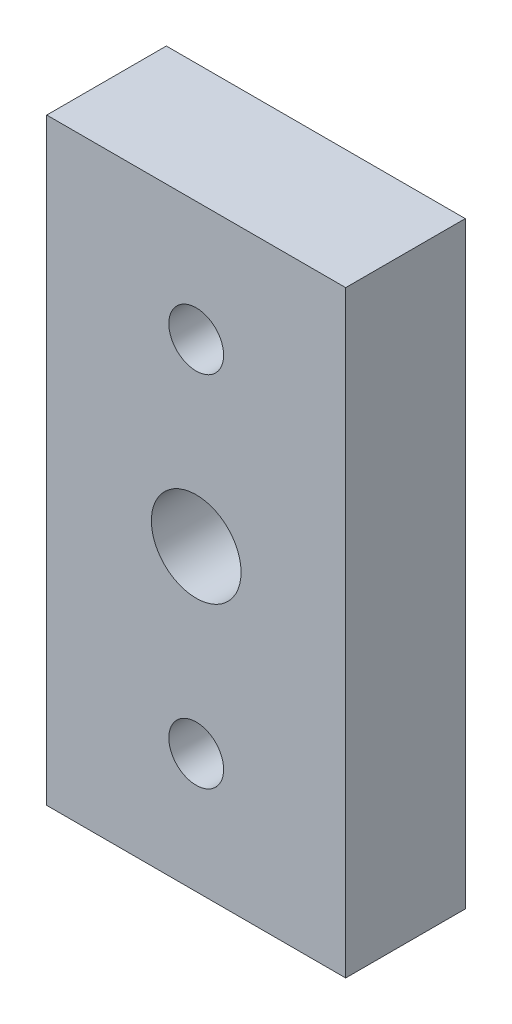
ISO-10303-21;
HEADER;
FILE_DESCRIPTION(('STEP AP214'),'2;1');
FILE_NAME('part.step','',(''),(''),'','','');
FILE_SCHEMA(('AUTOMOTIVE_DESIGN { 1 0 10303 214 1 1 1 1 }'));
ENDSEC;
DATA;
#1=APPLICATION_CONTEXT('core data for automotive mechanical design processes');
#2=APPLICATION_PROTOCOL_DEFINITION('international standard','automotive_design',2000,#1);
#3=PRODUCT_CONTEXT('',#1,'mechanical');
#4=PRODUCT('Part','Part','',(#3));
#5=PRODUCT_RELATED_PRODUCT_CATEGORY('part','',(#4));
#6=PRODUCT_DEFINITION_FORMATION('','',#4);
#7=PRODUCT_DEFINITION_CONTEXT('part definition',#1,'design');
#8=PRODUCT_DEFINITION('design','',#6,#7);
#9=PRODUCT_DEFINITION_SHAPE('','',#8);
#10=(LENGTH_UNIT() NAMED_UNIT(*) SI_UNIT(.MILLI.,.METRE.));
#11=(NAMED_UNIT(*) PLANE_ANGLE_UNIT() SI_UNIT($,.RADIAN.));
#12=(NAMED_UNIT(*) SI_UNIT($,.STERADIAN.) SOLID_ANGLE_UNIT());
#13=UNCERTAINTY_MEASURE_WITH_UNIT(LENGTH_MEASURE(1.E-05),#10,'distance_accuracy_value','');
#14=(GEOMETRIC_REPRESENTATION_CONTEXT(3) GLOBAL_UNCERTAINTY_ASSIGNED_CONTEXT((#13)) GLOBAL_UNIT_ASSIGNED_CONTEXT((#10,
#11,#12)) REPRESENTATION_CONTEXT('',''));
#15=CARTESIAN_POINT('',(0.,0.,0.));
#16=DIRECTION('',(0.,0.,1.));
#17=DIRECTION('',(1.,0.,0.));
#18=AXIS2_PLACEMENT_3D('',#15,#16,#17);
#19=CARTESIAN_POINT('',(15.,-18.,-1.));
#20=DIRECTION('',(0.,0.,-1.));
#21=DIRECTION('',(0.,1.,0.));
#22=AXIS2_PLACEMENT_3D('',#19,#20,#21);
#23=CYLINDRICAL_SURFACE('',#22,5.);
#24=CARTESIAN_POINT('',(15.,-18.,-1.));
#25=DIRECTION('',(0.,0.,-1.));
#26=DIRECTION('',(0.,1.,0.));
#27=AXIS2_PLACEMENT_3D('',#24,#25,#26);
#28=CIRCLE('',#27,5.);
#29=CARTESIAN_POINT('',(10.0023531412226,-18.1533814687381,-1.));
#30=VERTEX_POINT('',#29);
#31=CARTESIAN_POINT('',(11.8057041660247,-21.8466185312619,-1.));
#32=VERTEX_POINT('',#31);
#33=EDGE_CURVE('E284',#30,#32,#28,.T.);
#34=ORIENTED_EDGE('',*,*,#33,.F.);
#35=CARTESIAN_POINT('',(10.0023531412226,-18.1533814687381,-1.));
#36=CARTESIAN_POINT('',(10.0031940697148,-18.1807028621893,-1.05046474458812));
#37=CARTESIAN_POINT('',(10.0043182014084,-18.2101012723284,-1.09980010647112));
#38=CARTESIAN_POINT('',(10.0073494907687,-18.2728249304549,-1.19588974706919));
#39=CARTESIAN_POINT('',(10.0092567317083,-18.306150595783,-1.24264375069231));
#40=CARTESIAN_POINT('',(10.0140708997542,-18.3764975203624,-1.33323987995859));
#41=CARTESIAN_POINT('',(10.016977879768,-18.4135189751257,-1.37708185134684));
#42=CARTESIAN_POINT('',(10.024009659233,-18.4909536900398,-1.46152881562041));
#43=CARTESIAN_POINT('',(10.0281343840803,-18.5313667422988,-1.50213400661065));
#44=CARTESIAN_POINT('',(10.0426828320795,-18.6573701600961,-1.61877072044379));
#45=CARTESIAN_POINT('',(10.0552785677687,-18.7476835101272,-1.68957038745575));
#46=CARTESIAN_POINT('',(10.0877541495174,-18.9376045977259,-1.81501358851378));
#47=CARTESIAN_POINT('',(10.1076299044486,-19.0372070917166,-1.86966616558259));
#48=CARTESIAN_POINT('',(10.1551019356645,-19.2399872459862,-1.96073151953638));
#49=CARTESIAN_POINT('',(10.1825219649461,-19.3430410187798,-1.99751316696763));
#50=CARTESIAN_POINT('',(10.2454605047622,-19.5511739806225,-2.05430612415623));
#51=CARTESIAN_POINT('',(10.2809705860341,-19.656250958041,-2.07433478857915));
#52=CARTESIAN_POINT('',(10.3353654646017,-19.8008449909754,-2.09092796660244));
#53=CARTESIAN_POINT('',(10.3510331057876,-19.8409129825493,-2.09434711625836));
#54=CARTESIAN_POINT('',(10.3834345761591,-19.9207237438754,-2.09888349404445));
#55=CARTESIAN_POINT('',(10.4001678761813,-19.9604666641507,-2.10000185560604));
#56=CARTESIAN_POINT('',(10.474200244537,-20.1300699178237,-2.09999389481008));
#57=CARTESIAN_POINT('',(10.5366390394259,-20.2578710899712,-2.08786146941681));
#58=CARTESIAN_POINT('',(10.6704427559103,-20.5049631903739,-2.04228193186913));
#59=CARTESIAN_POINT('',(10.7418386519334,-20.6242222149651,-2.00875912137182));
#60=CARTESIAN_POINT('',(10.8901450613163,-20.8508398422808,-1.92369467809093));
#61=CARTESIAN_POINT('',(10.9670076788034,-20.9582848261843,-1.87229713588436));
#62=CARTESIAN_POINT('',(11.1240160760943,-21.1612000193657,-1.75369017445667));
#63=CARTESIAN_POINT('',(11.2041592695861,-21.2566794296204,-1.68649302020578));
#64=CARTESIAN_POINT('',(11.329524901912,-21.3959044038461,-1.5702542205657));
#65=CARTESIAN_POINT('',(11.3746492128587,-21.4439755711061,-1.52617308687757));
#66=CARTESIAN_POINT('',(11.4643905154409,-21.5360421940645,-1.43347117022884));
#67=CARTESIAN_POINT('',(11.5090076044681,-21.5800384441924,-1.38485127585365));
#68=CARTESIAN_POINT('',(11.5970226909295,-21.6637990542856,-1.28301646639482));
#69=CARTESIAN_POINT('',(11.6404203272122,-21.7035621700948,-1.22980020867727));
#70=CARTESIAN_POINT('',(11.7249953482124,-21.7785692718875,-1.11855252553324));
#71=CARTESIAN_POINT('',(11.7661708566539,-21.8138094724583,-1.06051713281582));
#72=CARTESIAN_POINT('',(11.8057041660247,-21.8466185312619,-1.));
#73=B_SPLINE_CURVE_WITH_KNOTS('',3,(#35,#36,#37,#38,#39,#40,#41,#42,#43,#44,#45,#46,#47,#48,#49,
#50,#51,#52,#53,#54,#55,#56,#57,#58,#59,#60,#61,#62,#63,#64,#65,#66,#67,#68,#69,#70,#71,#72),
.UNSPECIFIED.,.F.,.F.,(4,2,2,2,2,2,2,2,2,2,2,2,2,2,2,2,2,2,4),(0.,0.172126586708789,
0.344271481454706,0.516425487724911,0.688568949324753,1.03305493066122,1.37734761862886,
1.7141951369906,2.05069327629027,2.18010948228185,2.30946191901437,2.73504859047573,
3.16214978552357,3.58588494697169,4.00929224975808,4.24702628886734,4.48471388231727,
4.72247114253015,4.9604261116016),.UNSPECIFIED.);
#74=EDGE_CURVE('E127',#30,#32,#73,.T.);
#75=ORIENTED_EDGE('',*,*,#74,.T.);
#76=EDGE_LOOP('',(#34,#75));
#77=FACE_BOUND('',#76,.T.);
#78=CARTESIAN_POINT('',(15.,-18.,-6.));
#79=DIRECTION('',(0.,0.,-1.));
#80=DIRECTION('',(0.,1.,0.));
#81=AXIS2_PLACEMENT_3D('',#78,#79,#80);
#82=CIRCLE('',#81,5.);
#83=CARTESIAN_POINT('',(15.,-13.,-6.));
#84=VERTEX_POINT('',#83);
#85=EDGE_CURVE('E350',#84,#84,#82,.T.);
#86=ORIENTED_EDGE('',*,*,#85,.T.);
#87=EDGE_LOOP('',(#86));
#88=FACE_BOUND('',#87,.T.);
#89=ADVANCED_FACE('F17',(#77,#88),#23,.F.);
#90=CARTESIAN_POINT('',(15.,18.,-0.999999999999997));
#91=DIRECTION('',(0.,0.,-1.));
#92=DIRECTION('',(0.,1.,0.));
#93=AXIS2_PLACEMENT_3D('',#90,#91,#92);
#94=CYLINDRICAL_SURFACE('',#93,5.);
#95=CARTESIAN_POINT('',(15.,18.,-0.999999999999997));
#96=DIRECTION('',(0.,0.,-1.));
#97=DIRECTION('',(0.,1.,0.));
#98=AXIS2_PLACEMENT_3D('',#95,#96,#97);
#99=CIRCLE('',#98,5.);
#100=CARTESIAN_POINT('',(11.8057041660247,21.8466185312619,-0.999999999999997));
#101=VERTEX_POINT('',#100);
#102=CARTESIAN_POINT('',(10.0023531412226,18.1533814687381,-0.999999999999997));
#103=VERTEX_POINT('',#102);
#104=EDGE_CURVE('E123',#101,#103,#99,.T.);
#105=ORIENTED_EDGE('',*,*,#104,.F.);
#106=CARTESIAN_POINT('',(11.8057041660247,21.8466185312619,-0.999999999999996));
#107=CARTESIAN_POINT('',(11.7834305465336,21.8281239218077,-1.03414557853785));
#108=CARTESIAN_POINT('',(11.760610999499,21.8088454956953,-1.0674909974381));
#109=CARTESIAN_POINT('',(11.7141016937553,21.7687943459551,-1.13262108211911));
#110=CARTESIAN_POINT('',(11.6904122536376,21.7480221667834,-1.16440630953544));
#111=CARTESIAN_POINT('',(11.6183967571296,21.6835989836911,-1.2574521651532));
#112=CARTESIAN_POINT('',(11.5690759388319,21.6378022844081,-1.3164743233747));
#113=CARTESIAN_POINT('',(11.4688748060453,21.5406286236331,-1.42899049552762));
#114=CARTESIAN_POINT('',(11.4179879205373,21.4892248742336,-1.48245535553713));
#115=CARTESIAN_POINT('',(11.3158998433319,21.3812636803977,-1.58353477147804));
#116=CARTESIAN_POINT('',(11.2646985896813,21.3247051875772,-1.63114813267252));
#117=CARTESIAN_POINT('',(11.1213350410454,21.1584621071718,-1.7566977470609));
#118=CARTESIAN_POINT('',(11.029695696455,21.0429527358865,-1.82783578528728));
#119=CARTESIAN_POINT('',(10.8970401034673,20.8585797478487,-1.91767974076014));
#120=CARTESIAN_POINT('',(10.853666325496,20.7953447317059,-1.94479702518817));
#121=CARTESIAN_POINT('',(10.7689270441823,20.6653382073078,-1.99302030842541));
#122=CARTESIAN_POINT('',(10.7275607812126,20.5985680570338,-2.01412859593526));
#123=CARTESIAN_POINT('',(10.6380455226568,20.445991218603,-2.05393746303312));
#124=CARTESIAN_POINT('',(10.5905412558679,20.3593540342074,-2.07095136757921));
#125=CARTESIAN_POINT('',(10.5002481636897,20.1822279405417,-2.09398428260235));
#126=CARTESIAN_POINT('',(10.4574591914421,20.091739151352,-2.10000363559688));
#127=CARTESIAN_POINT('',(10.3709483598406,19.8935012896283,-2.09999577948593));
#128=CARTESIAN_POINT('',(10.328183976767,19.7853175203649,-2.09187463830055));
#129=CARTESIAN_POINT('',(10.251039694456,19.5686314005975,-2.0581395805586));
#130=CARTESIAN_POINT('',(10.2166603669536,19.4601290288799,-2.03252447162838));
#131=CARTESIAN_POINT('',(10.1565131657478,19.246199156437,-1.96327498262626));
#132=CARTESIAN_POINT('',(10.1307659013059,19.1407795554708,-1.91959802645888));
#133=CARTESIAN_POINT('',(10.0875033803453,18.9371386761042,-1.81478300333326));
#134=CARTESIAN_POINT('',(10.0699898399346,18.8389189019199,-1.7536413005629));
#135=CARTESIAN_POINT('',(10.0424888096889,18.6567186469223,-1.61803269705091));
#136=CARTESIAN_POINT('',(10.0322478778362,18.5723469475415,-1.54413953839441));
#137=CARTESIAN_POINT('',(10.0167440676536,18.416308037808,-1.38362432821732));
#138=CARTESIAN_POINT('',(10.0114755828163,18.3446265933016,-1.29701674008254));
#139=CARTESIAN_POINT('',(10.0065667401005,18.2572186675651,-1.1723252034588));
#140=CARTESIAN_POINT('',(10.005482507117,18.2350466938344,-1.13866923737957));
#141=CARTESIAN_POINT('',(10.0036705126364,18.1927109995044,-1.07019583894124));
#142=CARTESIAN_POINT('',(10.0029420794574,18.1725435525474,-1.03538072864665));
#143=CARTESIAN_POINT('',(10.0023531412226,18.1533814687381,-0.999999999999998));
#144=B_SPLINE_CURVE_WITH_KNOTS('',3,(#106,#107,#108,#109,#110,#111,#112,#113,#114,#115,#116,
#117,#118,#119,#120,#121,#122,#123,#124,#125,#126,#127,#128,#129,#130,#131,#132,#133,#134,#135,
#136,#137,#138,#139,#140,#141,#142,#143),.UNSPECIFIED.,.F.,.F.,(4,2,2,2,2,2,2,2,2,2,2,2,2,2,2,2,
2,2,4),(0.,0.134259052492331,0.268469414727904,0.536608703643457,0.806090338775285,
1.07562690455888,1.56418087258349,1.80793285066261,2.05159186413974,2.35161892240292,
2.65163663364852,2.99992303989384,3.34823318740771,3.69736910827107,4.04657776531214,
4.3829242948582,4.7188911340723,4.83979261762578,4.9604649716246),.UNSPECIFIED.);
#145=EDGE_CURVE('E21',#101,#103,#144,.T.);
#146=ORIENTED_EDGE('',*,*,#145,.T.);
#147=EDGE_LOOP('',(#105,#146));
#148=FACE_BOUND('',#147,.T.);
#149=CARTESIAN_POINT('',(15.,18.,-6.));
#150=DIRECTION('',(0.,0.,-1.));
#151=DIRECTION('',(0.,1.,0.));
#152=AXIS2_PLACEMENT_3D('',#149,#150,#151);
#153=CIRCLE('',#152,5.);
#154=CARTESIAN_POINT('',(15.,23.,-6.));
#155=VERTEX_POINT('',#154);
#156=EDGE_CURVE('E348',#155,#155,#153,.T.);
#157=ORIENTED_EDGE('',*,*,#156,.T.);
#158=EDGE_LOOP('',(#157));
#159=FACE_BOUND('',#158,.T.);
#160=ADVANCED_FACE('F121',(#148,#159),#94,.F.);
#161=CARTESIAN_POINT('',(0.,20.,0.));
#162=DIRECTION('',(-1.,0.,0.));
#163=DIRECTION('',(0.,0.,1.));
#164=AXIS2_PLACEMENT_3D('',#161,#162,#163);
#165=CYLINDRICAL_SURFACE('',#164,2.1);
#166=CARTESIAN_POINT('',(12.4000000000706,20.,0.));
#167=DIRECTION('',(-1.,0.,0.));
#168=DIRECTION('',(0.,0.,1.));
#169=AXIS2_PLACEMENT_3D('',#166,#167,#168);
#170=CIRCLE('',#169,2.09999999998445);
#171=CARTESIAN_POINT('',(12.4000000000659,21.8466185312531,-0.999999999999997));
#172=VERTEX_POINT('',#171);
#173=CARTESIAN_POINT('',(12.4000000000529,20.,2.09999999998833));
#174=VERTEX_POINT('',#173);
#175=EDGE_CURVE('E156',#172,#174,#170,.F.);
#176=ORIENTED_EDGE('',*,*,#175,.T.);
#177=CARTESIAN_POINT('',(12.4000000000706,20.,0.));
#178=DIRECTION('',(-1.,0.,0.));
#179=DIRECTION('',(0.,0.,1.));
#180=AXIS2_PLACEMENT_3D('',#177,#178,#179);
#181=CIRCLE('',#180,2.09999999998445);
#182=CARTESIAN_POINT('',(12.4000000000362,18.8958236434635,1.78627953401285));
#183=VERTEX_POINT('',#182);
#184=EDGE_CURVE('E315',#174,#183,#181,.F.);
#185=ORIENTED_EDGE('',*,*,#184,.T.);
#186=CARTESIAN_POINT('',(12.4000000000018,18.8958236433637,1.78627953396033));
#187=CARTESIAN_POINT('',(12.3847910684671,18.8517040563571,1.75902403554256));
#188=CARTESIAN_POINT('',(12.3710813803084,18.8082457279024,1.72988584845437));
#189=CARTESIAN_POINT('',(12.3464169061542,18.7231509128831,1.66805433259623));
#190=CARTESIAN_POINT('',(12.3354605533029,18.6815134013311,1.63536304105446));
#191=CARTESIAN_POINT('',(12.3160643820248,18.600599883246,1.56668189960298));
#192=CARTESIAN_POINT('',(12.3076189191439,18.5613187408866,1.53069968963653));
#193=CARTESIAN_POINT('',(12.2929040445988,18.4854131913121,1.45563715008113));
#194=CARTESIAN_POINT('',(12.2866347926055,18.4487889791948,1.41655659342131));
#195=CARTESIAN_POINT('',(12.2706198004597,18.3435343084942,1.29520218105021));
#196=CARTESIAN_POINT('',(12.2636240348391,18.2793272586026,1.20865080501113));
#197=CARTESIAN_POINT('',(12.2543497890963,18.1649575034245,1.0267214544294));
#198=CARTESIAN_POINT('',(12.2520637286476,18.1147723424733,0.931357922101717));
#199=CARTESIAN_POINT('',(12.2505915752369,18.0586024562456,0.801345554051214));
#200=CARTESIAN_POINT('',(12.2503545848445,18.0457811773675,0.769547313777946));
#201=CARTESIAN_POINT('',(12.2500594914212,18.0217071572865,0.705360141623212));
#202=CARTESIAN_POINT('',(12.2500014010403,18.0104545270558,0.672971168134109));
#203=CARTESIAN_POINT('',(12.2499951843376,17.9640656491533,0.528057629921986));
#204=CARTESIAN_POINT('',(12.2506601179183,17.9375603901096,0.412615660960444));
#205=CARTESIAN_POINT('',(12.2516142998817,17.9042831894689,0.178768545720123));
#206=CARTESIAN_POINT('',(12.2519028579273,17.8975474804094,0.0603583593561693));
#207=CARTESIAN_POINT('',(12.251695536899,17.9035116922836,-0.156605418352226));
#208=CARTESIAN_POINT('',(12.2513198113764,17.913223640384,-0.255250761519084));
#209=CARTESIAN_POINT('',(12.2504712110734,17.9464266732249,-0.450089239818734));
#210=CARTESIAN_POINT('',(12.2499984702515,17.9698988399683,-0.546285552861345));
#211=CARTESIAN_POINT('',(12.2500010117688,18.0199087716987,-0.702501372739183));
#212=CARTESIAN_POINT('',(12.2502094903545,18.0427173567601,-0.763741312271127));
#213=CARTESIAN_POINT('',(12.2514879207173,18.0939159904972,-0.883801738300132));
#214=CARTESIAN_POINT('',(12.252557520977,18.1223037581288,-0.942623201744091));
#215=CARTESIAN_POINT('',(12.2542807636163,18.1533814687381,-0.999999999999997));
#216=B_SPLINE_CURVE_WITH_KNOTS('',3,(#186,#187,#188,#189,#190,#191,#192,#193,#194,#195,#196,
#197,#198,#199,#200,#201,#202,#203,#204,#205,#206,#207,#208,#209,#210,#211,#212,#213,#214,#215),
.UNSPECIFIED.,.F.,.F.,(4,2,2,2,2,2,2,2,2,2,2,2,2,2,4),(0.,0.162056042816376,0.324019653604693,
0.485616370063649,0.647224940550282,0.969676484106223,1.29160863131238,1.39443809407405,
1.49727482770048,1.85074574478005,2.20486408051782,2.50128318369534,2.79729571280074,
2.99307706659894,3.18877854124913),.UNSPECIFIED.);
#217=CARTESIAN_POINT('',(12.2542807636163,18.1533814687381,-0.999999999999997));
#218=VERTEX_POINT('',#217);
#219=EDGE_CURVE('E143',#183,#218,#216,.T.);
#220=ORIENTED_EDGE('',*,*,#219,.T.);
#221=DIRECTION('',(1.,0.,0.));
#222=VECTOR('',#221,1.);
#223=CARTESIAN_POINT('',(15.,18.1533814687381,-0.999999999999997));
#224=LINE('',#223,#222);
#225=EDGE_CURVE('E132',#103,#218,#224,.T.);
#226=ORIENTED_EDGE('',*,*,#225,.F.);
#227=ORIENTED_EDGE('',*,*,#145,.F.);
#228=DIRECTION('',(1.,0.,0.));
#229=VECTOR('',#228,1.);
#230=CARTESIAN_POINT('',(15.,21.8466185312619,-0.999999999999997));
#231=LINE('',#230,#229);
#232=EDGE_CURVE('E135',#172,#101,#231,.F.);
#233=ORIENTED_EDGE('',*,*,#232,.F.);
#234=EDGE_LOOP('',(#176,#185,#220,#226,#227,#233));
#235=FACE_BOUND('',#234,.T.);
#236=CARTESIAN_POINT('',(0.,20.,0.));
#237=DIRECTION('',(-1.,0.,0.));
#238=DIRECTION('',(0.,0.,1.));
#239=AXIS2_PLACEMENT_3D('',#236,#237,#238);
#240=CIRCLE('',#239,2.1);
#241=CARTESIAN_POINT('',(0.,20.,2.09999999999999));
#242=VERTEX_POINT('',#241);
#243=EDGE_CURVE('E344',#242,#242,#240,.T.);
#244=ORIENTED_EDGE('',*,*,#243,.T.);
#245=EDGE_LOOP('',(#244));
#246=FACE_BOUND('',#245,.T.);
#247=ADVANCED_FACE('F139',(#235,#246),#165,.F.);
#248=CARTESIAN_POINT('',(0.,-20.,0.));
#249=DIRECTION('',(-1.,0.,0.));
#250=DIRECTION('',(0.,0.,1.));
#251=AXIS2_PLACEMENT_3D('',#248,#249,#250);
#252=CYLINDRICAL_SURFACE('',#251,2.1);
#253=CARTESIAN_POINT('',(12.4000000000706,-20.,0.));
#254=DIRECTION('',(-1.,0.,0.));
#255=DIRECTION('',(0.,0.,1.));
#256=AXIS2_PLACEMENT_3D('',#253,#254,#255);
#257=CIRCLE('',#256,2.09999999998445);
#258=CARTESIAN_POINT('',(12.4000000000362,-18.8958236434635,1.78627953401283));
#259=VERTEX_POINT('',#258);
#260=CARTESIAN_POINT('',(12.4000000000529,-20.,2.09999999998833));
#261=VERTEX_POINT('',#260);
#262=EDGE_CURVE('E306',#259,#261,#257,.F.);
#263=ORIENTED_EDGE('',*,*,#262,.T.);
#264=CARTESIAN_POINT('',(12.4000000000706,-20.,0.));
#265=DIRECTION('',(-1.,0.,0.));
#266=DIRECTION('',(0.,0.,1.));
#267=AXIS2_PLACEMENT_3D('',#264,#265,#266);
#268=CIRCLE('',#267,2.09999999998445);
#269=CARTESIAN_POINT('',(12.4000000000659,-21.8466185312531,-1.));
#270=VERTEX_POINT('',#269);
#271=EDGE_CURVE('E149',#261,#270,#268,.F.);
#272=ORIENTED_EDGE('',*,*,#271,.T.);
#273=DIRECTION('',(1.,0.,0.));
#274=VECTOR('',#273,1.);
#275=CARTESIAN_POINT('',(15.,-21.8466185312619,-1.));
#276=LINE('',#275,#274);
#277=EDGE_CURVE('E291',#32,#270,#276,.T.);
#278=ORIENTED_EDGE('',*,*,#277,.F.);
#279=ORIENTED_EDGE('',*,*,#74,.F.);
#280=DIRECTION('',(1.,0.,0.));
#281=VECTOR('',#280,1.);
#282=CARTESIAN_POINT('',(15.,-18.1533814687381,-1.));
#283=LINE('',#282,#281);
#284=CARTESIAN_POINT('',(12.2542807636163,-18.1533814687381,-1.));
#285=VERTEX_POINT('',#284);
#286=EDGE_CURVE('E292',#285,#30,#283,.F.);
#287=ORIENTED_EDGE('',*,*,#286,.F.);
#288=CARTESIAN_POINT('',(12.2542807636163,-18.1533814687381,-1.));
#289=CARTESIAN_POINT('',(12.2525574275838,-18.1223281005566,-0.942662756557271));
#290=CARTESIAN_POINT('',(12.2514888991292,-18.0939614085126,-0.883893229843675));
#291=CARTESIAN_POINT('',(12.2502105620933,-18.0427544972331,-0.763843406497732));
#292=CARTESIAN_POINT('',(12.2500024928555,-18.0199255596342,-0.702558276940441));
#293=CARTESIAN_POINT('',(12.2499954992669,-17.9640253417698,-0.527930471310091));
#294=CARTESIAN_POINT('',(12.2506611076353,-17.9375147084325,-0.412416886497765));
#295=CARTESIAN_POINT('',(12.2516148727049,-17.9042746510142,-0.178585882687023));
#296=CARTESIAN_POINT('',(12.2519029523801,-17.8975492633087,-0.0602678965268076));
#297=CARTESIAN_POINT('',(12.2516954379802,-17.9035107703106,0.156550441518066));
#298=CARTESIAN_POINT('',(12.251319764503,-17.913216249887,0.255141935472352));
#299=CARTESIAN_POINT('',(12.2504722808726,-17.9463939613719,0.449962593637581));
#300=CARTESIAN_POINT('',(12.2500004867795,-17.9698638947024,0.546192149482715));
#301=CARTESIAN_POINT('',(12.249999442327,-18.0345250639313,0.748140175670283));
#302=CARTESIAN_POINT('',(12.2506174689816,-18.0777993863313,0.853199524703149));
#303=CARTESIAN_POINT('',(12.2554608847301,-18.1807058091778,1.05499770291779));
#304=CARTESIAN_POINT('',(12.2596894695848,-18.2403523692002,1.15172907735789));
#305=CARTESIAN_POINT('',(12.2747911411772,-18.3745440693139,1.33444745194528));
#306=CARTESIAN_POINT('',(12.2856913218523,-18.4491491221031,1.42038890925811));
#307=CARTESIAN_POINT('',(12.3093475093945,-18.5697080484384,1.53865208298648));
#308=CARTESIAN_POINT('',(12.3184410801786,-18.6113020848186,1.57627425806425));
#309=CARTESIAN_POINT('',(12.3394127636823,-18.696931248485,1.64775927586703));
#310=CARTESIAN_POINT('',(12.3512888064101,-18.7409645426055,1.68162488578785));
#311=CARTESIAN_POINT('',(12.3700805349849,-18.8039771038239,1.72627351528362));
#312=CARTESIAN_POINT('',(12.3757091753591,-18.822173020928,1.73873734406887));
#313=CARTESIAN_POINT('',(12.3874712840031,-18.8588151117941,1.76300278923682));
#314=CARTESIAN_POINT('',(12.3936042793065,-18.877261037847,1.77480500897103));
#315=CARTESIAN_POINT('',(12.4000000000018,-18.8958236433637,1.78627953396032));
#316=B_SPLINE_CURVE_WITH_KNOTS('',3,(#288,#289,#290,#291,#292,#293,#294,#295,#296,#297,#298,
#299,#300,#301,#302,#303,#304,#305,#306,#307,#308,#309,#310,#311,#312,#313,#314,#315),
.UNSPECIFIED.,.F.,.F.,(4,2,2,2,2,2,2,2,2,2,2,2,2,4),(0.,0.195543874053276,0.391482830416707,
0.74524137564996,1.09907208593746,1.39531263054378,1.69150371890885,2.03083145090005,
2.37045983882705,2.71147672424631,2.88173194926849,3.05186091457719,3.12013472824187,
3.18834523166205),.UNSPECIFIED.);
#317=EDGE_CURVE('E205',#285,#259,#316,.T.);
#318=ORIENTED_EDGE('',*,*,#317,.T.);
#319=EDGE_LOOP('',(#263,#272,#278,#279,#287,#318));
#320=FACE_BOUND('',#319,.T.);
#321=CARTESIAN_POINT('',(0.,-20.,0.));
#322=DIRECTION('',(-1.,0.,0.));
#323=DIRECTION('',(0.,0.,1.));
#324=AXIS2_PLACEMENT_3D('',#321,#322,#323);
#325=CIRCLE('',#324,2.1);
#326=CARTESIAN_POINT('',(0.,-20.,2.09999999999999));
#327=VERTEX_POINT('',#326);
#328=EDGE_CURVE('E340',#327,#327,#325,.T.);
#329=ORIENTED_EDGE('',*,*,#328,.T.);
#330=EDGE_LOOP('',(#329));
#331=FACE_BOUND('',#330,.T.);
#332=ADVANCED_FACE('F267',(#320,#331),#252,.F.);
#333=CARTESIAN_POINT('',(15.,18.,-0.999999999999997));
#334=DIRECTION('',(0.,0.,-1.));
#335=DIRECTION('',(0.,1.,0.));
#336=AXIS2_PLACEMENT_3D('',#333,#334,#335);
#337=PLANE('',#336);
#338=ORIENTED_EDGE('',*,*,#232,.T.);
#339=ORIENTED_EDGE('',*,*,#104,.T.);
#340=ORIENTED_EDGE('',*,*,#225,.T.);
#341=CARTESIAN_POINT('',(15.,18.,-0.999999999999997));
#342=DIRECTION('',(0.,0.,1.));
#343=DIRECTION('',(1.,0.,0.));
#344=AXIS2_PLACEMENT_3D('',#341,#342,#343);
#345=CIRCLE('',#344,2.75);
#346=CARTESIAN_POINT('',(13.0601733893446,19.9492493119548,-0.999999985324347));
#347=VERTEX_POINT('',#346);
#348=EDGE_CURVE('E333',#218,#347,#345,.T.);
#349=ORIENTED_EDGE('',*,*,#348,.T.);
#350=CARTESIAN_POINT('',(13.0601733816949,19.9492493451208,-1.00000000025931));
#351=CARTESIAN_POINT('',(13.0604310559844,19.9577058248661,-1.00000000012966));
#352=CARTESIAN_POINT('',(13.0606243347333,19.9661632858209,-1.00000000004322));
#353=CARTESIAN_POINT('',(13.0608821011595,19.9830801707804,-0.999999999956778));
#354=CARTESIAN_POINT('',(13.0609465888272,19.9915395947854,-0.999999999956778));
#355=CARTESIAN_POINT('',(13.0609466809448,20.,-0.999999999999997));
#356=B_SPLINE_CURVE_WITH_KNOTS('',3,(#350,#351,#352,#353,#354,#355),.UNSPECIFIED.,.F.,.F.,(4,2,
4),(0.,0.0253790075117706,0.0507580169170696),.UNSPECIFIED.);
#357=CARTESIAN_POINT('',(13.0609466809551,20.,-0.999999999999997));
#358=VERTEX_POINT('',#357);
#359=EDGE_CURVE('E136',#347,#358,#356,.T.);
#360=ORIENTED_EDGE('',*,*,#359,.T.);
#361=CARTESIAN_POINT('',(13.0609466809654,20.,-0.999999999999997));
#362=CARTESIAN_POINT('',(13.0609921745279,20.0458391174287,-0.999999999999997));
#363=CARTESIAN_POINT('',(13.0590528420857,20.0916511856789,-0.999999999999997));
#364=CARTESIAN_POINT('',(13.0515717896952,20.1828832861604,-0.999999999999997));
#365=CARTESIAN_POINT('',(13.046037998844,20.2283039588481,-0.999999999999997));
#366=CARTESIAN_POINT('',(13.0318002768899,20.3181899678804,-0.999999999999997));
#367=CARTESIAN_POINT('',(13.0231269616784,20.3626602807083,-0.999999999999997));
#368=CARTESIAN_POINT('',(13.0031215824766,20.4510085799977,-0.999999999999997));
#369=CARTESIAN_POINT('',(12.9917883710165,20.4948863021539,-0.999999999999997));
#370=CARTESIAN_POINT('',(12.9632578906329,20.5950500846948,-0.999999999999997));
#371=CARTESIAN_POINT('',(12.9453204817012,20.6511233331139,-0.999999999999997));
#372=CARTESIAN_POINT('',(12.906751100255,20.7623437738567,-0.999999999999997));
#373=CARTESIAN_POINT('',(12.886118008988,20.817490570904,-0.999999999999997));
#374=CARTESIAN_POINT('',(12.8428217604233,20.9271108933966,-0.999999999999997));
#375=CARTESIAN_POINT('',(12.8201543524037,20.9815827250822,-0.999999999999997));
#376=CARTESIAN_POINT('',(12.7733377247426,21.0898870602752,-0.999999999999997));
#377=CARTESIAN_POINT('',(12.7491883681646,21.1437195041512,-0.999999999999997));
#378=CARTESIAN_POINT('',(12.6990697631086,21.2523969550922,-0.999999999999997));
#379=CARTESIAN_POINT('',(12.6730682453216,21.3072270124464,-0.999999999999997));
#380=CARTESIAN_POINT('',(12.6201669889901,21.4164549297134,-0.999999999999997));
#381=CARTESIAN_POINT('',(12.5932671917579,21.4708527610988,-0.999999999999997));
#382=CARTESIAN_POINT('',(12.5389402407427,21.5789735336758,-0.999999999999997));
#383=CARTESIAN_POINT('',(12.511517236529,21.6326985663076,-0.999999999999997));
#384=CARTESIAN_POINT('',(12.45613062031,21.7398583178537,-0.999999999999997));
#385=CARTESIAN_POINT('',(12.4281670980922,21.7932930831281,-0.999999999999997));
#386=CARTESIAN_POINT('',(12.4000000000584,21.8466185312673,-0.999999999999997));
#387=B_SPLINE_CURVE_WITH_KNOTS('',3,(#361,#362,#363,#364,#365,#366,#367,#368,#369,#370,#371,
#372,#373,#374,#375,#376,#377,#378,#379,#380,#381,#382,#383,#384,#385,#386),.UNSPECIFIED.,.F.,
.F.,(4,2,2,2,2,2,2,2,2,2,2,2,4),(0.,0.137433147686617,0.274564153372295,0.410392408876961,
0.546279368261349,0.722798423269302,0.899390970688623,1.07636150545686,1.2533484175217,
1.43538653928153,1.61743657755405,1.79839066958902,1.97931495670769),.UNSPECIFIED.);
#388=EDGE_CURVE('E159',#358,#172,#387,.T.);
#389=ORIENTED_EDGE('',*,*,#388,.T.);
#390=EDGE_LOOP('',(#338,#339,#340,#349,#360,#389));
#391=FACE_BOUND('',#390,.T.);
#392=ADVANCED_FACE('F130',(#391),#337,.T.);
#393=CARTESIAN_POINT('',(13.0598591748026,20.,0.));
#394=DIRECTION('',(-1.,0.,0.));
#395=DIRECTION('',(0.,-1.,0.));
#396=AXIS2_PLACEMENT_3D('',#393,#394,#395);
#397=CONICAL_SURFACE('',#396,1.00180991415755,1.02974425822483);
#398=DIRECTION('',(0.515038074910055,0.,0.857167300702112));
#399=VECTOR('',#398,1.);
#400=CARTESIAN_POINT('',(-299815.787087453,20.0000000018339,-499000.));
#401=LINE('',#400,#399);
#402=CARTESIAN_POINT('',(13.1125413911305,20.0000000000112,-0.914131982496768));
#403=VERTEX_POINT('',#402);
#404=EDGE_CURVE('E158',#403,#358,#401,.F.);
#405=ORIENTED_EDGE('',*,*,#404,.T.);
#406=ORIENTED_EDGE('',*,*,#359,.F.);
#407=CARTESIAN_POINT('',(13.0601733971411,19.9492492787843,-0.999999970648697));
#408=CARTESIAN_POINT('',(13.0689290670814,19.9579589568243,-0.985854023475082));
#409=CARTESIAN_POINT('',(13.0776708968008,19.9665430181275,-0.97162539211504));
#410=CARTESIAN_POINT('',(13.0951268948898,19.9834599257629,-0.943002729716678));
#411=CARTESIAN_POINT('',(13.1038410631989,19.9917927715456,-0.928608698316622));
#412=CARTESIAN_POINT('',(13.1125413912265,20.0000000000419,-0.914131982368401));
#413=B_SPLINE_CURVE_WITH_KNOTS('',3,(#407,#408,#409,#410,#411,#412),.UNSPECIFIED.,.F.,.F.,(4,2,
4),(0.,0.0563297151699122,0.112659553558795),.UNSPECIFIED.);
#414=EDGE_CURVE('E325',#347,#403,#413,.T.);
#415=ORIENTED_EDGE('',*,*,#414,.T.);
#416=EDGE_LOOP('',(#405,#406,#415));
#417=FACE_BOUND('',#416,.T.);
#418=ADVANCED_FACE('F241',(#417),#397,.F.);
#419=CARTESIAN_POINT('',(12.4000000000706,20.,0.));
#420=DIRECTION('',(-1.,0.,0.));
#421=DIRECTION('',(0.,0.,1.));
#422=AXIS2_PLACEMENT_3D('',#419,#420,#421);
#423=CONICAL_SURFACE('',#422,2.09999999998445,1.02974425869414);
#424=CARTESIAN_POINT('',(13.1125413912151,20.0000000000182,-0.914131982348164));
#425=CARTESIAN_POINT('',(13.1332503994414,20.0195461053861,-0.879637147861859));
#426=CARTESIAN_POINT('',(13.1538800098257,20.0384041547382,-0.844702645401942));
#427=CARTESIAN_POINT('',(13.1948175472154,20.0747443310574,-0.77388174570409));
#428=CARTESIAN_POINT('',(13.2151251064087,20.0922249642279,-0.737994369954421));
#429=CARTESIAN_POINT('',(13.2555654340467,20.1260655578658,-0.664624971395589));
#430=CARTESIAN_POINT('',(13.2756887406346,20.1424001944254,-0.627125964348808));
#431=CARTESIAN_POINT('',(13.3150195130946,20.1734693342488,-0.55102654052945));
#432=CARTESIAN_POINT('',(13.3342274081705,20.1882045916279,-0.512426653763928));
#433=CARTESIAN_POINT('',(13.3732204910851,20.2173720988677,-0.429442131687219));
#434=CARTESIAN_POINT('',(13.392830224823,20.2315863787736,-0.384893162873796));
#435=CARTESIAN_POINT('',(13.4195637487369,20.250520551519,-0.31640268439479));
#436=CARTESIAN_POINT('',(13.4280208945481,20.2564293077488,-0.293318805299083));
#437=CARTESIAN_POINT('',(13.4436814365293,20.2672587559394,-0.246512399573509));
#438=CARTESIAN_POINT('',(13.4508853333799,20.2721798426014,-0.222790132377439));
#439=CARTESIAN_POINT('',(13.4662033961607,20.2825615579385,-0.164626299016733));
#440=CARTESIAN_POINT('',(13.4734566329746,20.2873999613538,-0.129818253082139));
#441=CARTESIAN_POINT('',(13.4805818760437,20.2921335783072,-0.0769646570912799));
#442=CARTESIAN_POINT('',(13.4823314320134,20.2932909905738,-0.0592792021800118));
#443=CARTESIAN_POINT('',(13.4844710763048,20.2947056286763,-0.0237872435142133));
#444=CARTESIAN_POINT('',(13.484861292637,20.2949629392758,-0.00598075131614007));
#445=CARTESIAN_POINT('',(13.4842483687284,20.2945581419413,0.0296312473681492));
#446=CARTESIAN_POINT('',(13.4832425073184,20.2938942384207,0.047436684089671));
#447=CARTESIAN_POINT('',(13.4799122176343,20.291688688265,0.0828699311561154));
#448=CARTESIAN_POINT('',(13.4775874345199,20.2901468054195,0.100497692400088));
#449=CARTESIAN_POINT('',(13.4717643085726,20.28626502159,0.135566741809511));
#450=CARTESIAN_POINT('',(13.468259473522,20.2839207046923,0.153006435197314));
#451=CARTESIAN_POINT('',(13.4602723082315,20.2785438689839,0.187547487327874));
#452=CARTESIAN_POINT('',(13.4557899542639,20.2755113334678,0.204648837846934));
#453=CARTESIAN_POINT('',(13.4378731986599,20.2632950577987,0.266924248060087));
#454=CARTESIAN_POINT('',(13.422038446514,20.2523284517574,0.311050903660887));
#455=CARTESIAN_POINT('',(13.3874136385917,20.2276719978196,0.39735530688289));
#456=CARTESIAN_POINT('',(13.3686161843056,20.2139753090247,0.439527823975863));
#457=CARTESIAN_POINT('',(13.3293147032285,20.1844720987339,0.522538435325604));
#458=CARTESIAN_POINT('',(13.3088039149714,20.1686570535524,0.563370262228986));
#459=CARTESIAN_POINT('',(13.2668311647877,20.1352626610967,0.643806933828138));
#460=CARTESIAN_POINT('',(13.2453689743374,20.1176828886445,0.683411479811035));
#461=CARTESIAN_POINT('',(13.2053400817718,20.0838113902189,0.755310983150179));
#462=CARTESIAN_POINT('',(13.1868563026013,20.0677600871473,0.78776595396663));
#463=CARTESIAN_POINT('',(13.149783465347,20.0346528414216,0.851640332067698));
#464=CARTESIAN_POINT('',(13.131196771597,20.0176070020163,0.883066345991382));
#465=CARTESIAN_POINT('',(13.1125413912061,20.0000000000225,0.914131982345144));
#466=B_SPLINE_CURVE_WITH_KNOTS('',3,(#424,#425,#426,#427,#428,#429,#430,#431,#432,#433,#434,
#435,#436,#437,#438,#439,#440,#441,#442,#443,#444,#445,#446,#447,#448,#449,#450,#451,#452,#453,
#454,#455,#456,#457,#458,#459,#460,#461,#462,#463,#464,#465),.UNSPECIFIED.,.F.,.F.,(4,2,2,2,2,2,
2,2,2,2,2,2,2,2,2,2,2,2,2,2,4),(0.,0.134185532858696,0.268514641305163,0.405222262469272,
0.541865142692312,0.693781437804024,0.769586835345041,0.845361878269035,0.952553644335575,
1.00591686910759,1.0592750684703,1.11273741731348,1.1662141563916,1.21999004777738,
1.27376724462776,1.41778516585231,1.56216860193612,1.70715150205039,1.85216941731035,
1.97410294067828,2.09496161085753),.UNSPECIFIED.);
#467=CARTESIAN_POINT('',(13.1125413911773,20.0000000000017,0.914131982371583));
#468=VERTEX_POINT('',#467);
#469=EDGE_CURVE('E246',#403,#468,#466,.T.);
#470=ORIENTED_EDGE('',*,*,#469,.T.);
#471=DIRECTION('',(0.515038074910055,0.,-0.857167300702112));
#472=VECTOR('',#471,1.);
#473=CARTESIAN_POINT('',(-299815.787087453,20.,499000.));
#474=LINE('',#473,#472);
#475=EDGE_CURVE('E310',#468,#174,#474,.F.);
#476=ORIENTED_EDGE('',*,*,#475,.T.);
#477=ORIENTED_EDGE('',*,*,#175,.F.);
#478=ORIENTED_EDGE('',*,*,#388,.F.);
#479=ORIENTED_EDGE('',*,*,#404,.F.);
#480=EDGE_LOOP('',(#470,#476,#477,#478,#479));
#481=FACE_BOUND('',#480,.T.);
#482=ADVANCED_FACE('F236',(#481),#423,.F.);
#483=CARTESIAN_POINT('',(12.4000000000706,20.,0.));
#484=DIRECTION('',(-1.,0.,0.));
#485=DIRECTION('',(0.,0.,1.));
#486=AXIS2_PLACEMENT_3D('',#483,#484,#485);
#487=CONICAL_SURFACE('',#486,2.09999999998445,1.02974425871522);
#488=CARTESIAN_POINT('',(13.1125413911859,20.0000000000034,0.914131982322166));
#489=CARTESIAN_POINT('',(13.0936568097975,19.9821774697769,0.945553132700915));
#490=CARTESIAN_POINT('',(13.0746957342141,19.9637784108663,0.976597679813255));
#491=CARTESIAN_POINT('',(13.0366754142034,19.9257672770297,1.03788839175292));
#492=CARTESIAN_POINT('',(13.0176161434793,19.9061548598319,1.06813432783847));
#493=CARTESIAN_POINT('',(12.9601011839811,19.8451172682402,1.1580305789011));
#494=CARTESIAN_POINT('',(12.9215956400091,19.8017593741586,1.21636261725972));
#495=CARTESIAN_POINT('',(12.8432385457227,19.7072829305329,1.3310039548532));
#496=CARTESIAN_POINT('',(12.8034014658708,19.6559085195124,1.38711432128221));
#497=CARTESIAN_POINT('',(12.7247804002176,19.5460975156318,1.49246174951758));
#498=CARTESIAN_POINT('',(12.6859931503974,19.4876869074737,1.54172273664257));
#499=CARTESIAN_POINT('',(12.6186527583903,19.376560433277,1.62065343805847));
#500=CARTESIAN_POINT('',(12.5897356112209,19.3254485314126,1.65224580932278));
#501=CARTESIAN_POINT('',(12.5340288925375,19.218628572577,1.70698336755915));
#502=CARTESIAN_POINT('',(12.5072171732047,19.16298625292,1.73022959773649));
#503=CARTESIAN_POINT('',(12.4671511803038,19.0716829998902,1.75839553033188));
#504=CARTESIAN_POINT('',(12.4529639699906,19.0375392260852,1.76690726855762));
#505=CARTESIAN_POINT('',(12.4256087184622,18.9676995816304,1.77986389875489));
#506=CARTESIAN_POINT('',(12.4124521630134,18.9319916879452,1.78426767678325));
#507=CARTESIAN_POINT('',(12.4000000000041,18.8958236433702,1.78627953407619));
#508=B_SPLINE_CURVE_WITH_KNOTS('',3,(#488,#489,#490,#491,#492,#493,#494,#495,#496,#497,#498,
#499,#500,#501,#502,#503,#504,#505,#506,#507),.UNSPECIFIED.,.F.,.F.,(4,2,2,2,2,2,2,2,2,4),(0.,
0.122273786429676,0.244582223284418,0.491047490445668,0.748253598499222,1.00453739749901,
1.20405949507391,1.40107740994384,1.5146604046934,1.62936835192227),.UNSPECIFIED.);
#509=EDGE_CURVE('E220',#468,#183,#508,.T.);
#510=ORIENTED_EDGE('',*,*,#509,.T.);
#511=ORIENTED_EDGE('',*,*,#184,.F.);
#512=ORIENTED_EDGE('',*,*,#475,.F.);
#513=EDGE_LOOP('',(#510,#511,#512));
#514=FACE_BOUND('',#513,.T.);
#515=ADVANCED_FACE('F230',(#514),#487,.F.);
#516=CARTESIAN_POINT('',(12.4000000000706,-20.,0.));
#517=DIRECTION('',(-1.,0.,0.));
#518=DIRECTION('',(0.,0.,1.));
#519=AXIS2_PLACEMENT_3D('',#516,#517,#518);
#520=CONICAL_SURFACE('',#519,2.09999999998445,1.02974425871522);
#521=DIRECTION('',(0.515038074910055,0.,-0.857167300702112));
#522=VECTOR('',#521,1.);
#523=CARTESIAN_POINT('',(-299815.787087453,-20.,499000.));
#524=LINE('',#523,#522);
#525=CARTESIAN_POINT('',(13.1125413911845,-20.0000000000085,0.914131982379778));
#526=VERTEX_POINT('',#525);
#527=EDGE_CURVE('E153',#526,#261,#524,.F.);
#528=ORIENTED_EDGE('',*,*,#527,.T.);
#529=ORIENTED_EDGE('',*,*,#262,.F.);
#530=CARTESIAN_POINT('',(12.3999999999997,-18.8958236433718,1.7862795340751));
#531=CARTESIAN_POINT('',(12.4106964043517,-18.9268836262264,1.78454817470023));
#532=CARTESIAN_POINT('',(12.4219137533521,-18.9576178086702,1.78105540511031));
#533=CARTESIAN_POINT('',(12.4452119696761,-19.0181356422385,1.77091479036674));
#534=CARTESIAN_POINT('',(12.4572904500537,-19.0479216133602,1.76427539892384));
#535=CARTESIAN_POINT('',(12.4941842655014,-19.1345832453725,1.7404520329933));
#536=CARTESIAN_POINT('',(12.5200612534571,-19.1899158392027,1.71927137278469));
#537=CARTESIAN_POINT('',(12.5839666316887,-19.3160757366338,1.65917412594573));
#538=CARTESIAN_POINT('',(12.6228342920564,-19.3846549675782,1.61656809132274));
#539=CARTESIAN_POINT('',(12.7029279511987,-19.5138796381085,1.5206754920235));
#540=CARTESIAN_POINT('',(12.744179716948,-19.5743976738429,1.46724497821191));
#541=CARTESIAN_POINT('',(12.8131912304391,-19.6680770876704,1.37302839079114));
#542=CARTESIAN_POINT('',(12.8407025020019,-19.7034798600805,1.3342285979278));
#543=CARTESIAN_POINT('',(12.8959435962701,-19.7712594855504,1.25417298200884));
#544=CARTESIAN_POINT('',(12.9236735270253,-19.8036347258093,1.21291586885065));
#545=CARTESIAN_POINT('',(12.9783717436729,-19.8647121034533,1.12961173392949));
#546=CARTESIAN_POINT('',(13.0053390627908,-19.8934929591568,1.08762130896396));
#547=CARTESIAN_POINT('',(13.0591009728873,-19.9485595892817,1.00203634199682));
#548=CARTESIAN_POINT('',(13.0858957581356,-19.9748489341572,0.958444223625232));
#549=CARTESIAN_POINT('',(13.1125413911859,-20.0000000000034,0.914131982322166));
#550=B_SPLINE_CURVE_WITH_KNOTS('',3,(#530,#531,#532,#533,#534,#535,#536,#537,#538,#539,#540,
#541,#542,#543,#544,#545,#546,#547,#548,#549),.UNSPECIFIED.,.F.,.F.,(4,2,2,2,2,2,2,2,2,4),(0.,
0.098563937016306,0.196864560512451,0.389854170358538,0.657229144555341,0.928425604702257,
1.10618205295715,1.28403266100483,1.45678214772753,1.629280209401),.UNSPECIFIED.);
#551=EDGE_CURVE('E213',#259,#526,#550,.T.);
#552=ORIENTED_EDGE('',*,*,#551,.T.);
#553=EDGE_LOOP('',(#528,#529,#552));
#554=FACE_BOUND('',#553,.T.);
#555=ADVANCED_FACE('F226',(#554),#520,.F.);
#556=CARTESIAN_POINT('',(12.4000000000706,-20.,0.));
#557=DIRECTION('',(-1.,0.,0.));
#558=DIRECTION('',(0.,0.,1.));
#559=AXIS2_PLACEMENT_3D('',#556,#557,#558);
#560=CONICAL_SURFACE('',#559,2.09999999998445,1.02974425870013);
#561=DIRECTION('',(0.515038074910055,0.,0.857167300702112));
#562=VECTOR('',#561,1.);
#563=CARTESIAN_POINT('',(-299815.787087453,-20.0000000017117,-499000.));
#564=LINE('',#563,#562);
#565=CARTESIAN_POINT('',(13.1125413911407,-20.0000000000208,-0.914131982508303));
#566=VERTEX_POINT('',#565);
#567=CARTESIAN_POINT('',(13.0609466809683,-20.,-0.999999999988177));
#568=VERTEX_POINT('',#567);
#569=EDGE_CURVE('E152',#566,#568,#564,.F.);
#570=ORIENTED_EDGE('',*,*,#569,.T.);
#571=CARTESIAN_POINT('',(12.4000000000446,-21.8466185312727,-0.999999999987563));
#572=CARTESIAN_POINT('',(12.4271213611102,-21.7952745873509,-0.999999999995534));
#573=CARTESIAN_POINT('',(12.4540530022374,-21.7438289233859,-0.999999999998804));
#574=CARTESIAN_POINT('',(12.5074192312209,-21.6406717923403,-1.0000000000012));
#575=CARTESIAN_POINT('',(12.5338537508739,-21.5889602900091,-1.00000000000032));
#576=CARTESIAN_POINT('',(12.5862210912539,-21.4849839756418,-0.999999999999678));
#577=CARTESIAN_POINT('',(12.6121510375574,-21.4327177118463,-0.999999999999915));
#578=CARTESIAN_POINT('',(12.6632046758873,-21.3277949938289,-1.00000000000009));
#579=CARTESIAN_POINT('',(12.6883284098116,-21.2751385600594,-1.00000000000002));
#580=CARTESIAN_POINT('',(12.7369112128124,-21.1706694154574,-0.999999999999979));
#581=CARTESIAN_POINT('',(12.7603962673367,-21.1188688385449,-0.999999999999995));
#582=CARTESIAN_POINT('',(12.8060627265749,-21.0146971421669,-1.00000000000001));
#583=CARTESIAN_POINT('',(12.8282442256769,-20.9623260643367,-1.));
#584=CARTESIAN_POINT('',(12.8708459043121,-20.8569573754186,-1.));
#585=CARTESIAN_POINT('',(12.8912686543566,-20.8039608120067,-1.));
#586=CARTESIAN_POINT('',(12.9297978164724,-20.6971389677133,-1.));
#587=CARTESIAN_POINT('',(12.9479049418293,-20.6433139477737,-1.));
#588=CARTESIAN_POINT('',(12.9789484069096,-20.5415089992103,-1.));
#589=CARTESIAN_POINT('',(12.9922483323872,-20.4936413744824,-1.));
#590=CARTESIAN_POINT('',(13.0158270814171,-20.3971904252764,-1.));
#591=CARTESIAN_POINT('',(13.0261079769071,-20.3486076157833,-1.));
#592=CARTESIAN_POINT('',(13.0430624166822,-20.2502933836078,-1.));
#593=CARTESIAN_POINT('',(13.0496988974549,-20.200555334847,-1.));
#594=CARTESIAN_POINT('',(13.0564095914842,-20.1255942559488,-1.));
#595=CARTESIAN_POINT('',(13.0581059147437,-20.1005104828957,-1.));
#596=CARTESIAN_POINT('',(13.0603764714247,-20.0502857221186,-1.));
#597=CARTESIAN_POINT('',(13.0609504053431,-20.025144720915,-1.));
#598=CARTESIAN_POINT('',(13.0609466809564,-20.,-1.));
#599=B_SPLINE_CURVE_WITH_KNOTS('',3,(#571,#572,#573,#574,#575,#576,#577,#578,#579,#580,#581,
#582,#583,#584,#585,#586,#587,#588,#589,#590,#591,#592,#593,#594,#595,#596,#597,#598),
.UNSPECIFIED.,.F.,.F.,(4,2,2,2,2,2,2,2,2,2,2,2,2,4),(0.,0.174202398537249,0.348428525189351,
0.523457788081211,0.698477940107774,0.869091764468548,1.03969321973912,1.21004094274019,
1.38033606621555,1.52930131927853,1.67816409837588,1.82851401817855,1.90391464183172,
1.97933538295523),.UNSPECIFIED.);
#600=EDGE_CURVE('E296',#270,#568,#599,.T.);
#601=ORIENTED_EDGE('',*,*,#600,.F.);
#602=ORIENTED_EDGE('',*,*,#271,.F.);
#603=ORIENTED_EDGE('',*,*,#527,.F.);
#604=CARTESIAN_POINT('',(13.1125413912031,-20.0000000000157,0.914131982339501));
#605=CARTESIAN_POINT('',(13.1332503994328,-20.0195461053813,0.879637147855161));
#606=CARTESIAN_POINT('',(13.1538800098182,-20.0384041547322,0.84470264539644));
#607=CARTESIAN_POINT('',(13.194817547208,-20.0747443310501,0.773881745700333));
#608=CARTESIAN_POINT('',(13.2151251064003,-20.0922249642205,0.737994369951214));
#609=CARTESIAN_POINT('',(13.2555654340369,-20.1260655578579,0.664624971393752));
#610=CARTESIAN_POINT('',(13.2756887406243,-20.1424001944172,0.627125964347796));
#611=CARTESIAN_POINT('',(13.3150195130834,-20.17346933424,0.551026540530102));
#612=CARTESIAN_POINT('',(13.3342274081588,-20.188204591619,0.512426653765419));
#613=CARTESIAN_POINT('',(13.3732204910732,-20.217372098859,0.429442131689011));
#614=CARTESIAN_POINT('',(13.3928302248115,-20.2315863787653,0.384893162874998));
#615=CARTESIAN_POINT('',(13.4195637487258,-20.2505205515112,0.31640268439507));
#616=CARTESIAN_POINT('',(13.4280208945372,-20.2564293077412,0.293318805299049));
#617=CARTESIAN_POINT('',(13.4436814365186,-20.267258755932,0.246512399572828));
#618=CARTESIAN_POINT('',(13.4508853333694,-20.2721798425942,0.222790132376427));
#619=CARTESIAN_POINT('',(13.4662033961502,-20.2825615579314,0.164626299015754));
#620=CARTESIAN_POINT('',(13.473456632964,-20.2873999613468,0.129818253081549));
#621=CARTESIAN_POINT('',(13.4805818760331,-20.2921335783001,0.0769646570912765));
#622=CARTESIAN_POINT('',(13.4823314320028,-20.2932909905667,0.0592792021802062));
#623=CARTESIAN_POINT('',(13.4844710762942,-20.2947056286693,0.0237872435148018));
#624=CARTESIAN_POINT('',(13.4848612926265,-20.2949629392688,0.00598075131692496));
#625=CARTESIAN_POINT('',(13.4842483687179,-20.2945581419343,-0.0296312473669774));
#626=CARTESIAN_POINT('',(13.4832425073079,-20.2938942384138,-0.0474366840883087));
#627=CARTESIAN_POINT('',(13.4799122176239,-20.291688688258,-0.0828699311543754));
#628=CARTESIAN_POINT('',(13.4775874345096,-20.2901468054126,-0.10049769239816));
#629=CARTESIAN_POINT('',(13.4717643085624,-20.2862650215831,-0.135566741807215));
#630=CARTESIAN_POINT('',(13.4682594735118,-20.2839207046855,-0.153006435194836));
#631=CARTESIAN_POINT('',(13.4602723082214,-20.2785438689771,-0.187547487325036));
#632=CARTESIAN_POINT('',(13.455789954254,-20.275511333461,-0.204648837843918));
#633=CARTESIAN_POINT('',(13.43787319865,-20.2632950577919,-0.266924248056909));
#634=CARTESIAN_POINT('',(13.4220384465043,-20.2523284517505,-0.311050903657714));
#635=CARTESIAN_POINT('',(13.387413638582,-20.2276719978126,-0.397355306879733));
#636=CARTESIAN_POINT('',(13.368616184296,-20.2139753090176,-0.439527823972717));
#637=CARTESIAN_POINT('',(13.329314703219,-20.1844720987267,-0.522538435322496));
#638=CARTESIAN_POINT('',(13.3088039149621,-20.1686570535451,-0.563370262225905));
#639=CARTESIAN_POINT('',(13.2668311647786,-20.1352626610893,-0.643806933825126));
#640=CARTESIAN_POINT('',(13.2453689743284,-20.117682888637,-0.683411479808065));
#641=CARTESIAN_POINT('',(13.2053400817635,-20.0838113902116,-0.755310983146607));
#642=CARTESIAN_POINT('',(13.1868563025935,-20.0677600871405,-0.787765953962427));
#643=CARTESIAN_POINT('',(13.1497834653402,-20.0346528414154,-0.851640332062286));
#644=CARTESIAN_POINT('',(13.1311967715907,-20.0176070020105,-0.883066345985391));
#645=CARTESIAN_POINT('',(13.1125413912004,-20.000000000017,-0.914131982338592));
#646=B_SPLINE_CURVE_WITH_KNOTS('',3,(#604,#605,#606,#607,#608,#609,#610,#611,#612,#613,#614,
#615,#616,#617,#618,#619,#620,#621,#622,#623,#624,#625,#626,#627,#628,#629,#630,#631,#632,#633,
#634,#635,#636,#637,#638,#639,#640,#641,#642,#643,#644,#645),.UNSPECIFIED.,.F.,.F.,(4,2,2,2,2,2,
2,2,2,2,2,2,2,2,2,2,2,2,2,2,4),(0.,0.134185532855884,0.268514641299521,0.40522226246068,
0.541865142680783,0.69378143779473,0.769586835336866,0.845361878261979,0.95255364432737,
1.0059168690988,1.05927506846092,1.11273741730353,1.16621415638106,1.21999004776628,
1.27376724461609,1.41778516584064,1.56216860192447,1.70715150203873,1.85216941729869,
1.97410294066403,2.09496161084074),.UNSPECIFIED.);
#647=EDGE_CURVE('E182',#526,#566,#646,.T.);
#648=ORIENTED_EDGE('',*,*,#647,.T.);
#649=EDGE_LOOP('',(#570,#601,#602,#603,#648));
#650=FACE_BOUND('',#649,.T.);
#651=ADVANCED_FACE('F229',(#650),#560,.F.);
#652=CARTESIAN_POINT('',(13.0598591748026,-20.,0.));
#653=DIRECTION('',(-1.,0.,0.));
#654=DIRECTION('',(0.,-1.,0.));
#655=AXIS2_PLACEMENT_3D('',#652,#653,#654);
#656=CONICAL_SURFACE('',#655,1.00180991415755,1.02974425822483);
#657=CARTESIAN_POINT('',(13.11254139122,-20.0000000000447,-0.914131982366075));
#658=CARTESIAN_POINT('',(13.1038410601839,-19.9917927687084,-0.928608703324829));
#659=CARTESIAN_POINT('',(13.095126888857,-19.9834599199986,-0.943002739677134));
#660=CARTESIAN_POINT('',(13.0776708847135,-19.9665430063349,-0.97162541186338));
#661=CARTESIAN_POINT('',(13.0689290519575,-19.9579589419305,-0.985854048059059));
#662=CARTESIAN_POINT('',(13.0601733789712,-19.9492492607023,-1.00000000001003));
#663=B_SPLINE_CURVE_WITH_KNOTS('',3,(#657,#658,#659,#660,#661,#662),.UNSPECIFIED.,.F.,.F.,(4,2,
4),(0.,0.0563298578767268,0.11265959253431),.UNSPECIFIED.);
#664=CARTESIAN_POINT('',(13.06017337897,-19.9492492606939,-1.));
#665=VERTEX_POINT('',#664);
#666=EDGE_CURVE('E174',#566,#665,#663,.T.);
#667=ORIENTED_EDGE('',*,*,#666,.T.);
#668=CARTESIAN_POINT('',(13.0609466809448,-20.,-1.));
#669=CARTESIAN_POINT('',(13.0609465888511,-19.9915395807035,-1.));
#670=CARTESIAN_POINT('',(13.0608821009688,-19.9830801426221,-1.));
#671=CARTESIAN_POINT('',(13.0606243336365,-19.9661632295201,-1.));
#672=CARTESIAN_POINT('',(13.0604310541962,-19.9577057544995,-1.));
#673=CARTESIAN_POINT('',(13.0601733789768,-19.9492492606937,-1.));
#674=B_SPLINE_CURVE_WITH_KNOTS('',3,(#668,#669,#670,#671,#672,#673),.UNSPECIFIED.,.F.,.F.,(4,2,
4),(0.,0.025379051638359,0.0507581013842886),.UNSPECIFIED.);
#675=EDGE_CURVE('E257',#568,#665,#674,.T.);
#676=ORIENTED_EDGE('',*,*,#675,.F.);
#677=ORIENTED_EDGE('',*,*,#569,.F.);
#678=EDGE_LOOP('',(#667,#676,#677));
#679=FACE_BOUND('',#678,.T.);
#680=ADVANCED_FACE('F188',(#679),#656,.F.);
#681=CARTESIAN_POINT('',(15.,-18.,-1.));
#682=DIRECTION('',(0.,0.,-1.));
#683=DIRECTION('',(0.,1.,0.));
#684=AXIS2_PLACEMENT_3D('',#681,#682,#683);
#685=PLANE('',#684);
#686=ORIENTED_EDGE('',*,*,#277,.T.);
#687=ORIENTED_EDGE('',*,*,#600,.T.);
#688=ORIENTED_EDGE('',*,*,#675,.T.);
#689=CARTESIAN_POINT('',(15.,-18.,-1.));
#690=DIRECTION('',(0.,0.,1.));
#691=DIRECTION('',(1.,0.,0.));
#692=AXIS2_PLACEMENT_3D('',#689,#690,#691);
#693=CIRCLE('',#692,2.75);
#694=EDGE_CURVE('E172',#665,#285,#693,.T.);
#695=ORIENTED_EDGE('',*,*,#694,.T.);
#696=ORIENTED_EDGE('',*,*,#286,.T.);
#697=ORIENTED_EDGE('',*,*,#33,.T.);
#698=EDGE_LOOP('',(#686,#687,#688,#695,#696,#697));
#699=FACE_BOUND('',#698,.T.);
#700=ADVANCED_FACE('F289',(#699),#685,.T.);
#701=CARTESIAN_POINT('',(30.,30.,-6.));
#702=DIRECTION('',(0.,0.,1.));
#703=DIRECTION('',(0.,-1.,0.));
#704=AXIS2_PLACEMENT_3D('',#701,#702,#703);
#705=PLANE('',#704);
#706=DIRECTION('',(1.,0.,0.));
#707=VECTOR('',#706,1.);
#708=CARTESIAN_POINT('',(30.,30.,-6.));
#709=LINE('',#708,#707);
#710=CARTESIAN_POINT('',(0.,30.,-6.));
#711=VERTEX_POINT('',#710);
#712=CARTESIAN_POINT('',(30.,30.,-6.));
#713=VERTEX_POINT('',#712);
#714=EDGE_CURVE('E300',#711,#713,#709,.T.);
#715=ORIENTED_EDGE('',*,*,#714,.T.);
#716=DIRECTION('',(0.,1.,0.));
#717=VECTOR('',#716,1.);
#718=CARTESIAN_POINT('',(30.,0.,-6.));
#719=LINE('',#718,#717);
#720=CARTESIAN_POINT('',(30.,-30.,-6.));
#721=VERTEX_POINT('',#720);
#722=EDGE_CURVE('E410',#721,#713,#719,.T.);
#723=ORIENTED_EDGE('',*,*,#722,.F.);
#724=DIRECTION('',(1.,0.,0.));
#725=VECTOR('',#724,1.);
#726=CARTESIAN_POINT('',(30.,-30.,-6.));
#727=LINE('',#726,#725);
#728=CARTESIAN_POINT('',(0.,-30.,-6.));
#729=VERTEX_POINT('',#728);
#730=EDGE_CURVE('E347',#721,#729,#727,.F.);
#731=ORIENTED_EDGE('',*,*,#730,.T.);
#732=DIRECTION('',(0.,1.,0.));
#733=VECTOR('',#732,1.);
#734=CARTESIAN_POINT('',(0.,0.,-6.));
#735=LINE('',#734,#733);
#736=EDGE_CURVE('E334',#729,#711,#735,.T.);
#737=ORIENTED_EDGE('',*,*,#736,.T.);
#738=EDGE_LOOP('',(#715,#723,#731,#737));
#739=FACE_BOUND('',#738,.T.);
#740=ORIENTED_EDGE('',*,*,#156,.F.);
#741=EDGE_LOOP('',(#740));
#742=FACE_BOUND('',#741,.T.);
#743=ORIENTED_EDGE('',*,*,#85,.F.);
#744=EDGE_LOOP('',(#743));
#745=FACE_BOUND('',#744,.T.);
#746=CARTESIAN_POINT('',(15.,0.,-6.));
#747=DIRECTION('',(0.,0.,1.));
#748=DIRECTION('',(1.,0.,0.));
#749=AXIS2_PLACEMENT_3D('',#746,#747,#748);
#750=CIRCLE('',#749,4.5);
#751=CARTESIAN_POINT('',(19.5,0.,-6.));
#752=VERTEX_POINT('',#751);
#753=EDGE_CURVE('E168',#752,#752,#750,.T.);
#754=ORIENTED_EDGE('',*,*,#753,.T.);
#755=EDGE_LOOP('',(#754));
#756=FACE_BOUND('',#755,.T.);
#757=ADVANCED_FACE('F370',(#739,#742,#745,#756),#705,.F.);
#758=CARTESIAN_POINT('',(30.,30.,6.));
#759=DIRECTION('',(0.,-1.,0.));
#760=DIRECTION('',(0.,0.,-1.));
#761=AXIS2_PLACEMENT_3D('',#758,#759,#760);
#762=PLANE('',#761);
#763=DIRECTION('',(1.,0.,0.));
#764=VECTOR('',#763,1.);
#765=CARTESIAN_POINT('',(30.,30.,6.));
#766=LINE('',#765,#764);
#767=CARTESIAN_POINT('',(0.,30.,6.));
#768=VERTEX_POINT('',#767);
#769=CARTESIAN_POINT('',(30.,30.,6.));
#770=VERTEX_POINT('',#769);
#771=EDGE_CURVE('E171',#768,#770,#766,.T.);
#772=ORIENTED_EDGE('',*,*,#771,.T.);
#773=DIRECTION('',(0.,0.,-1.));
#774=VECTOR('',#773,1.);
#775=CARTESIAN_POINT('',(30.,30.,0.));
#776=LINE('',#775,#774);
#777=EDGE_CURVE('E398',#713,#770,#776,.F.);
#778=ORIENTED_EDGE('',*,*,#777,.F.);
#779=ORIENTED_EDGE('',*,*,#714,.F.);
#780=DIRECTION('',(0.,0.,-1.));
#781=VECTOR('',#780,1.);
#782=CARTESIAN_POINT('',(0.,30.,0.));
#783=LINE('',#782,#781);
#784=EDGE_CURVE('E343',#711,#768,#783,.F.);
#785=ORIENTED_EDGE('',*,*,#784,.T.);
#786=EDGE_LOOP('',(#772,#778,#779,#785));
#787=FACE_BOUND('',#786,.T.);
#788=ADVANCED_FACE('F417',(#787),#762,.F.);
#789=CARTESIAN_POINT('',(30.,0.,0.));
#790=DIRECTION('',(1.,0.,0.));
#791=DIRECTION('',(0.,0.,-1.));
#792=AXIS2_PLACEMENT_3D('',#789,#790,#791);
#793=PLANE('',#792);
#794=DIRECTION('',(0.,1.,0.));
#795=VECTOR('',#794,1.);
#796=CARTESIAN_POINT('',(30.,30.,6.));
#797=LINE('',#796,#795);
#798=CARTESIAN_POINT('',(30.,-30.,6.));
#799=VERTEX_POINT('',#798);
#800=EDGE_CURVE('E389',#770,#799,#797,.F.);
#801=ORIENTED_EDGE('',*,*,#800,.T.);
#802=DIRECTION('',(0.,0.,1.));
#803=VECTOR('',#802,1.);
#804=CARTESIAN_POINT('',(30.,-30.,6.));
#805=LINE('',#804,#803);
#806=EDGE_CURVE('E396',#799,#721,#805,.F.);
#807=ORIENTED_EDGE('',*,*,#806,.T.);
#808=ORIENTED_EDGE('',*,*,#722,.T.);
#809=ORIENTED_EDGE('',*,*,#777,.T.);
#810=EDGE_LOOP('',(#801,#807,#808,#809));
#811=FACE_BOUND('',#810,.T.);
#812=ADVANCED_FACE('F395',(#811),#793,.T.);
#813=CARTESIAN_POINT('',(30.,-30.,6.));
#814=DIRECTION('',(0.,1.,0.));
#815=DIRECTION('',(0.,0.,1.));
#816=AXIS2_PLACEMENT_3D('',#813,#814,#815);
#817=PLANE('',#816);
#818=ORIENTED_EDGE('',*,*,#730,.F.);
#819=ORIENTED_EDGE('',*,*,#806,.F.);
#820=DIRECTION('',(1.,0.,0.));
#821=VECTOR('',#820,1.);
#822=CARTESIAN_POINT('',(30.,-30.,6.));
#823=LINE('',#822,#821);
#824=CARTESIAN_POINT('',(0.,-30.,6.));
#825=VERTEX_POINT('',#824);
#826=EDGE_CURVE('E387',#799,#825,#823,.F.);
#827=ORIENTED_EDGE('',*,*,#826,.T.);
#828=DIRECTION('',(0.,0.,-1.));
#829=VECTOR('',#828,1.);
#830=CARTESIAN_POINT('',(0.,-30.,0.));
#831=LINE('',#830,#829);
#832=EDGE_CURVE('E40',#825,#729,#831,.T.);
#833=ORIENTED_EDGE('',*,*,#832,.T.);
#834=EDGE_LOOP('',(#818,#819,#827,#833));
#835=FACE_BOUND('',#834,.T.);
#836=ADVANCED_FACE('F421',(#835),#817,.F.);
#837=CARTESIAN_POINT('',(0.,0.,0.));
#838=DIRECTION('',(1.,0.,0.));
#839=DIRECTION('',(0.,0.,-1.));
#840=AXIS2_PLACEMENT_3D('',#837,#838,#839);
#841=PLANE('',#840);
#842=ORIENTED_EDGE('',*,*,#832,.F.);
#843=DIRECTION('',(0.,1.,0.));
#844=VECTOR('',#843,1.);
#845=CARTESIAN_POINT('',(0.,30.,6.));
#846=LINE('',#845,#844);
#847=EDGE_CURVE('E167',#825,#768,#846,.T.);
#848=ORIENTED_EDGE('',*,*,#847,.T.);
#849=ORIENTED_EDGE('',*,*,#784,.F.);
#850=ORIENTED_EDGE('',*,*,#736,.F.);
#851=EDGE_LOOP('',(#842,#848,#849,#850));
#852=FACE_BOUND('',#851,.T.);
#853=ORIENTED_EDGE('',*,*,#328,.F.);
#854=EDGE_LOOP('',(#853));
#855=FACE_BOUND('',#854,.T.);
#856=ORIENTED_EDGE('',*,*,#243,.F.);
#857=EDGE_LOOP('',(#856));
#858=FACE_BOUND('',#857,.T.);
#859=ADVANCED_FACE('F418',(#852,#855,#858),#841,.F.);
#860=CARTESIAN_POINT('',(15.,18.,-6.));
#861=DIRECTION('',(0.,0.,1.));
#862=DIRECTION('',(1.,0.,0.));
#863=AXIS2_PLACEMENT_3D('',#860,#861,#862);
#864=CYLINDRICAL_SURFACE('',#863,2.75);
#865=ORIENTED_EDGE('',*,*,#348,.F.);
#866=ORIENTED_EDGE('',*,*,#219,.F.);
#867=ORIENTED_EDGE('',*,*,#509,.F.);
#868=ORIENTED_EDGE('',*,*,#469,.F.);
#869=ORIENTED_EDGE('',*,*,#414,.F.);
#870=EDGE_LOOP('',(#865,#866,#867,#868,#869));
#871=FACE_BOUND('',#870,.T.);
#872=CARTESIAN_POINT('',(15.,18.,6.));
#873=DIRECTION('',(0.,0.,1.));
#874=DIRECTION('',(1.,0.,0.));
#875=AXIS2_PLACEMENT_3D('',#872,#873,#874);
#876=CIRCLE('',#875,2.75);
#877=CARTESIAN_POINT('',(17.75,18.,6.));
#878=VERTEX_POINT('',#877);
#879=EDGE_CURVE('E164',#878,#878,#876,.T.);
#880=ORIENTED_EDGE('',*,*,#879,.T.);
#881=EDGE_LOOP('',(#880));
#882=FACE_BOUND('',#881,.T.);
#883=ADVANCED_FACE('F197',(#871,#882),#864,.F.);
#884=CARTESIAN_POINT('',(15.,-18.,-6.));
#885=DIRECTION('',(0.,0.,1.));
#886=DIRECTION('',(1.,0.,0.));
#887=AXIS2_PLACEMENT_3D('',#884,#885,#886);
#888=CYLINDRICAL_SURFACE('',#887,2.75);
#889=CARTESIAN_POINT('',(15.,-18.,6.));
#890=DIRECTION('',(0.,0.,1.));
#891=DIRECTION('',(1.,0.,0.));
#892=AXIS2_PLACEMENT_3D('',#889,#890,#891);
#893=CIRCLE('',#892,2.75);
#894=CARTESIAN_POINT('',(17.75,-18.,6.));
#895=VERTEX_POINT('',#894);
#896=EDGE_CURVE('E31',#895,#895,#893,.T.);
#897=ORIENTED_EDGE('',*,*,#896,.T.);
#898=EDGE_LOOP('',(#897));
#899=FACE_BOUND('',#898,.T.);
#900=ORIENTED_EDGE('',*,*,#694,.F.);
#901=ORIENTED_EDGE('',*,*,#666,.F.);
#902=ORIENTED_EDGE('',*,*,#647,.F.);
#903=ORIENTED_EDGE('',*,*,#551,.F.);
#904=ORIENTED_EDGE('',*,*,#317,.F.);
#905=EDGE_LOOP('',(#900,#901,#902,#903,#904));
#906=FACE_BOUND('',#905,.T.);
#907=ADVANCED_FACE('F191',(#899,#906),#888,.F.);
#908=CARTESIAN_POINT('',(15.,0.,6.));
#909=DIRECTION('',(0.,0.,1.));
#910=DIRECTION('',(1.,0.,0.));
#911=AXIS2_PLACEMENT_3D('',#908,#909,#910);
#912=CYLINDRICAL_SURFACE('',#911,4.5);
#913=ORIENTED_EDGE('',*,*,#753,.F.);
#914=EDGE_LOOP('',(#913));
#915=FACE_BOUND('',#914,.T.);
#916=CARTESIAN_POINT('',(15.,0.,6.));
#917=DIRECTION('',(0.,0.,1.));
#918=DIRECTION('',(1.,0.,0.));
#919=AXIS2_PLACEMENT_3D('',#916,#917,#918);
#920=CIRCLE('',#919,4.5);
#921=CARTESIAN_POINT('',(19.5,0.,6.));
#922=VERTEX_POINT('',#921);
#923=EDGE_CURVE('E11',#922,#922,#920,.T.);
#924=ORIENTED_EDGE('',*,*,#923,.T.);
#925=EDGE_LOOP('',(#924));
#926=FACE_BOUND('',#925,.T.);
#927=ADVANCED_FACE('F196',(#915,#926),#912,.F.);
#928=CARTESIAN_POINT('',(30.,30.,6.));
#929=DIRECTION('',(0.,0.,-1.));
#930=DIRECTION('',(0.,1.,0.));
#931=AXIS2_PLACEMENT_3D('',#928,#929,#930);
#932=PLANE('',#931);
#933=ORIENTED_EDGE('',*,*,#923,.F.);
#934=EDGE_LOOP('',(#933));
#935=FACE_BOUND('',#934,.T.);
#936=ORIENTED_EDGE('',*,*,#896,.F.);
#937=EDGE_LOOP('',(#936));
#938=FACE_BOUND('',#937,.T.);
#939=ORIENTED_EDGE('',*,*,#879,.F.);
#940=EDGE_LOOP('',(#939));
#941=FACE_BOUND('',#940,.T.);
#942=ORIENTED_EDGE('',*,*,#826,.F.);
#943=ORIENTED_EDGE('',*,*,#800,.F.);
#944=ORIENTED_EDGE('',*,*,#771,.F.);
#945=ORIENTED_EDGE('',*,*,#847,.F.);
#946=EDGE_LOOP('',(#942,#943,#944,#945));
#947=FACE_BOUND('',#946,.T.);
#948=ADVANCED_FACE('F371',(#935,#938,#941,#947),#932,.F.);
#949=CLOSED_SHELL('',(#89,#160,#247,#332,#392,#418,#482,#515,#555,#651,#680,#700,#757,#788,#812,
#836,#859,#883,#907,#927,#948));
#950=MANIFOLD_SOLID_BREP('B1',#949);
#951=ADVANCED_BREP_SHAPE_REPRESENTATION('',(#18,#950),#14);
#952=SHAPE_DEFINITION_REPRESENTATION(#9,#951);
ENDSEC;
END-ISO-10303-21;
